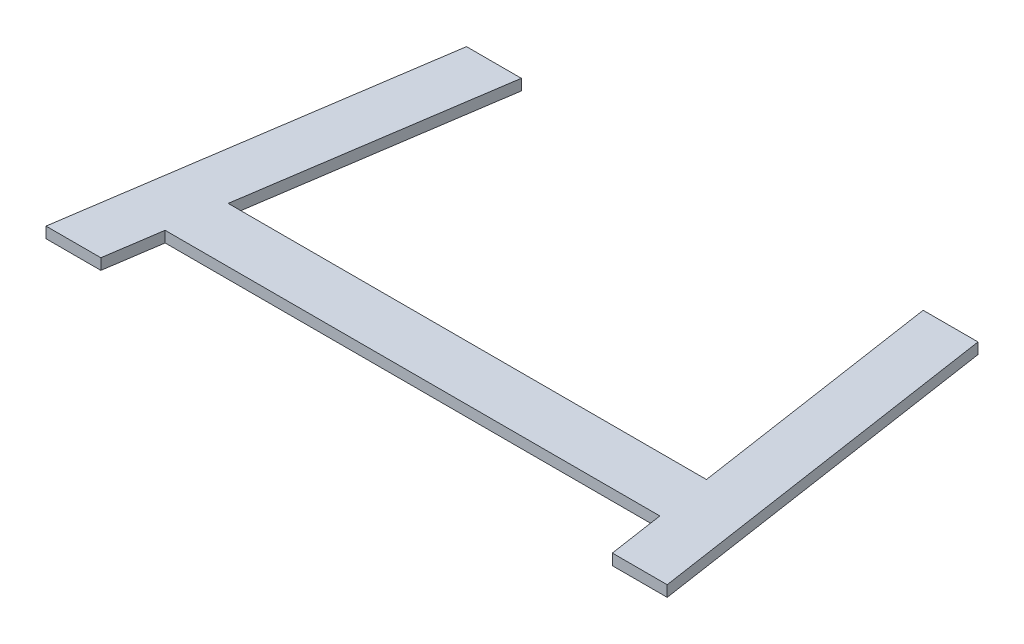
ISO-10303-21;
HEADER;
FILE_DESCRIPTION(('STEP AP214'),'2;1');
FILE_NAME('part.step','',(''),(''),'','','');
FILE_SCHEMA(('AUTOMOTIVE_DESIGN { 1 0 10303 214 1 1 1 1 }'));
ENDSEC;
DATA;
#1=APPLICATION_CONTEXT('core data for automotive mechanical design processes');
#2=APPLICATION_PROTOCOL_DEFINITION('international standard','automotive_design',2000,#1);
#3=PRODUCT_CONTEXT('',#1,'mechanical');
#4=PRODUCT('Part','Part','',(#3));
#5=PRODUCT_RELATED_PRODUCT_CATEGORY('part','',(#4));
#6=PRODUCT_DEFINITION_FORMATION('','',#4);
#7=PRODUCT_DEFINITION_CONTEXT('part definition',#1,'design');
#8=PRODUCT_DEFINITION('design','',#6,#7);
#9=PRODUCT_DEFINITION_SHAPE('','',#8);
#10=(LENGTH_UNIT() NAMED_UNIT(*) SI_UNIT(.MILLI.,.METRE.));
#11=(NAMED_UNIT(*) PLANE_ANGLE_UNIT() SI_UNIT($,.RADIAN.));
#12=(NAMED_UNIT(*) SI_UNIT($,.STERADIAN.) SOLID_ANGLE_UNIT());
#13=UNCERTAINTY_MEASURE_WITH_UNIT(LENGTH_MEASURE(1.E-05),#10,'distance_accuracy_value','');
#14=(GEOMETRIC_REPRESENTATION_CONTEXT(3) GLOBAL_UNCERTAINTY_ASSIGNED_CONTEXT((#13)) GLOBAL_UNIT_ASSIGNED_CONTEXT((#10,
#11,#12)) REPRESENTATION_CONTEXT('',''));
#15=CARTESIAN_POINT('',(0.,0.,0.));
#16=DIRECTION('',(0.,0.,1.));
#17=DIRECTION('',(1.,0.,0.));
#18=AXIS2_PLACEMENT_3D('',#15,#16,#17);
#19=CARTESIAN_POINT('',(30.,12.,-200.));
#20=DIRECTION('',(-0.988936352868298,0.,-0.148340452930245));
#21=DIRECTION('',(-0.148340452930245,0.,0.988936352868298));
#22=AXIS2_PLACEMENT_3D('',#19,#20,#21);
#23=PLANE('',#22);
#24=DIRECTION('',(0.148340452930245,0.,-0.988936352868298));
#25=VECTOR('',#24,1.);
#26=CARTESIAN_POINT('',(30.,0.,-200.));
#27=LINE('',#26,#25);
#28=CARTESIAN_POINT('',(-11.8291625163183,0.,78.8610834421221));
#29=VERTEX_POINT('',#28);
#30=CARTESIAN_POINT('',(30.,0.,-200.));
#31=VERTEX_POINT('',#30);
#32=EDGE_CURVE('E164',#29,#31,#27,.T.);
#33=ORIENTED_EDGE('',*,*,#32,.T.);
#34=DIRECTION('',(0.,-1.,0.));
#35=VECTOR('',#34,1.);
#36=CARTESIAN_POINT('',(30.,12.,-200.));
#37=LINE('',#36,#35);
#38=CARTESIAN_POINT('',(30.,12.,-200.));
#39=VERTEX_POINT('',#38);
#40=EDGE_CURVE('E11',#39,#31,#37,.T.);
#41=ORIENTED_EDGE('',*,*,#40,.F.);
#42=DIRECTION('',(0.148340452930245,0.,-0.988936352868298));
#43=VECTOR('',#42,1.);
#44=CARTESIAN_POINT('',(30.,12.,-200.));
#45=LINE('',#44,#43);
#46=CARTESIAN_POINT('',(-11.8291625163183,12.,78.8610834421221));
#47=VERTEX_POINT('',#46);
#48=EDGE_CURVE('E198',#47,#39,#45,.T.);
#49=ORIENTED_EDGE('',*,*,#48,.F.);
#50=DIRECTION('',(0.,-1.,0.));
#51=VECTOR('',#50,1.);
#52=CARTESIAN_POINT('',(-11.8291625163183,12.,78.8610834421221));
#53=LINE('',#52,#51);
#54=EDGE_CURVE('E160',#47,#29,#53,.T.);
#55=ORIENTED_EDGE('',*,*,#54,.T.);
#56=EDGE_LOOP('',(#33,#41,#49,#55));
#57=FACE_BOUND('',#56,.T.);
#58=ADVANCED_FACE('F39',(#57),#23,.F.);
#59=CARTESIAN_POINT('',(-30.,12.,-200.));
#60=DIRECTION('',(0.,0.,1.));
#61=DIRECTION('',(1.,0.,0.));
#62=AXIS2_PLACEMENT_3D('',#59,#60,#61);
#63=PLANE('',#62);
#64=DIRECTION('',(-1.,0.,0.));
#65=VECTOR('',#64,1.);
#66=CARTESIAN_POINT('',(-30.,0.,-200.));
#67=LINE('',#66,#65);
#68=CARTESIAN_POINT('',(-30.,0.,-200.));
#69=VERTEX_POINT('',#68);
#70=EDGE_CURVE('E168',#31,#69,#67,.T.);
#71=ORIENTED_EDGE('',*,*,#70,.T.);
#72=DIRECTION('',(0.,-1.,0.));
#73=VECTOR('',#72,1.);
#74=CARTESIAN_POINT('',(-30.,12.,-200.));
#75=LINE('',#74,#73);
#76=CARTESIAN_POINT('',(-30.,12.,-200.));
#77=VERTEX_POINT('',#76);
#78=EDGE_CURVE('E48',#77,#69,#75,.T.);
#79=ORIENTED_EDGE('',*,*,#78,.F.);
#80=DIRECTION('',(-1.,0.,0.));
#81=VECTOR('',#80,1.);
#82=CARTESIAN_POINT('',(-30.,12.,-200.));
#83=LINE('',#82,#81);
#84=EDGE_CURVE('E111',#39,#77,#83,.T.);
#85=ORIENTED_EDGE('',*,*,#84,.F.);
#86=ORIENTED_EDGE('',*,*,#40,.T.);
#87=EDGE_LOOP('',(#71,#79,#85,#86));
#88=FACE_BOUND('',#87,.T.);
#89=ADVANCED_FACE('F292',(#88),#63,.F.);
#90=CARTESIAN_POINT('',(-30.,12.,-200.));
#91=DIRECTION('',(0.988936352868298,0.,0.148340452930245));
#92=DIRECTION('',(0.148340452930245,0.,-0.988936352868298));
#93=AXIS2_PLACEMENT_3D('',#90,#91,#92);
#94=PLANE('',#93);
#95=DIRECTION('',(-0.148340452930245,0.,0.988936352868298));
#96=VECTOR('',#95,1.);
#97=CARTESIAN_POINT('',(-30.,0.,-200.));
#98=LINE('',#97,#96);
#99=CARTESIAN_POINT('',(-90.,0.,200.));
#100=VERTEX_POINT('',#99);
#101=EDGE_CURVE('E171',#69,#100,#98,.T.);
#102=ORIENTED_EDGE('',*,*,#101,.T.);
#103=DIRECTION('',(0.,-1.,0.));
#104=VECTOR('',#103,1.);
#105=CARTESIAN_POINT('',(-90.,12.,200.));
#106=LINE('',#105,#104);
#107=CARTESIAN_POINT('',(-90.,12.,200.));
#108=VERTEX_POINT('',#107);
#109=EDGE_CURVE('E225',#108,#100,#106,.T.);
#110=ORIENTED_EDGE('',*,*,#109,.F.);
#111=DIRECTION('',(-0.148340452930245,0.,0.988936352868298));
#112=VECTOR('',#111,1.);
#113=CARTESIAN_POINT('',(-30.,12.,-200.));
#114=LINE('',#113,#112);
#115=EDGE_CURVE('E235',#77,#108,#114,.T.);
#116=ORIENTED_EDGE('',*,*,#115,.F.);
#117=ORIENTED_EDGE('',*,*,#78,.T.);
#118=EDGE_LOOP('',(#102,#110,#116,#117));
#119=FACE_BOUND('',#118,.T.);
#120=ADVANCED_FACE('F233',(#119),#94,.F.);
#121=CARTESIAN_POINT('',(-90.,12.,200.));
#122=DIRECTION('',(0.,0.,-1.));
#123=DIRECTION('',(-1.,0.,0.));
#124=AXIS2_PLACEMENT_3D('',#121,#122,#123);
#125=PLANE('',#124);
#126=DIRECTION('',(1.,0.,0.));
#127=VECTOR('',#126,1.);
#128=CARTESIAN_POINT('',(-90.,0.,200.));
#129=LINE('',#128,#127);
#130=CARTESIAN_POINT('',(-30.,0.,200.));
#131=VERTEX_POINT('',#130);
#132=EDGE_CURVE('E174',#100,#131,#129,.T.);
#133=ORIENTED_EDGE('',*,*,#132,.T.);
#134=DIRECTION('',(0.,-1.,0.));
#135=VECTOR('',#134,1.);
#136=CARTESIAN_POINT('',(-30.,12.,200.));
#137=LINE('',#136,#135);
#138=CARTESIAN_POINT('',(-30.,12.,200.));
#139=VERTEX_POINT('',#138);
#140=EDGE_CURVE('E221',#139,#131,#137,.T.);
#141=ORIENTED_EDGE('',*,*,#140,.F.);
#142=DIRECTION('',(1.,0.,0.));
#143=VECTOR('',#142,1.);
#144=CARTESIAN_POINT('',(-90.,12.,200.));
#145=LINE('',#144,#143);
#146=EDGE_CURVE('E254',#108,#139,#145,.T.);
#147=ORIENTED_EDGE('',*,*,#146,.F.);
#148=ORIENTED_EDGE('',*,*,#109,.T.);
#149=EDGE_LOOP('',(#133,#141,#147,#148));
#150=FACE_BOUND('',#149,.T.);
#151=ADVANCED_FACE('F244',(#150),#125,.F.);
#152=CARTESIAN_POINT('',(-30.,12.,200.));
#153=DIRECTION('',(-0.988936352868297,0.,-0.148340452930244));
#154=DIRECTION('',(-0.148340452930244,0.,0.988936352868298));
#155=AXIS2_PLACEMENT_3D('',#152,#153,#154);
#156=PLANE('',#155);
#157=DIRECTION('',(0.148340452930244,0.,-0.988936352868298));
#158=VECTOR('',#157,1.);
#159=CARTESIAN_POINT('',(-30.,0.,200.));
#160=LINE('',#159,#158);
#161=CARTESIAN_POINT('',(-20.8291625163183,0.,138.861083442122));
#162=VERTEX_POINT('',#161);
#163=EDGE_CURVE('E177',#131,#162,#160,.T.);
#164=ORIENTED_EDGE('',*,*,#163,.T.);
#165=DIRECTION('',(0.,-1.,0.));
#166=VECTOR('',#165,1.);
#167=CARTESIAN_POINT('',(-20.8291625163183,12.,138.861083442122));
#168=LINE('',#167,#166);
#169=CARTESIAN_POINT('',(-20.8291625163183,12.,138.861083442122));
#170=VERTEX_POINT('',#169);
#171=EDGE_CURVE('E217',#170,#162,#168,.T.);
#172=ORIENTED_EDGE('',*,*,#171,.F.);
#173=DIRECTION('',(0.148340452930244,0.,-0.988936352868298));
#174=VECTOR('',#173,1.);
#175=CARTESIAN_POINT('',(-30.,12.,200.));
#176=LINE('',#175,#174);
#177=EDGE_CURVE('E250',#139,#170,#176,.T.);
#178=ORIENTED_EDGE('',*,*,#177,.F.);
#179=ORIENTED_EDGE('',*,*,#140,.T.);
#180=EDGE_LOOP('',(#164,#172,#178,#179));
#181=FACE_BOUND('',#180,.T.);
#182=ADVANCED_FACE('F248',(#181),#156,.F.);
#183=CARTESIAN_POINT('',(520.369162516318,12.,138.861083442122));
#184=DIRECTION('',(0.,0.,-1.));
#185=DIRECTION('',(-1.,0.,0.));
#186=AXIS2_PLACEMENT_3D('',#183,#184,#185);
#187=PLANE('',#186);
#188=DIRECTION('',(1.,0.,0.));
#189=VECTOR('',#188,1.);
#190=CARTESIAN_POINT('',(520.369162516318,0.,138.861083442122));
#191=LINE('',#190,#189);
#192=CARTESIAN_POINT('',(520.369162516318,0.,138.861083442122));
#193=VERTEX_POINT('',#192);
#194=EDGE_CURVE('E180',#162,#193,#191,.T.);
#195=ORIENTED_EDGE('',*,*,#194,.T.);
#196=DIRECTION('',(0.,-1.,0.));
#197=VECTOR('',#196,1.);
#198=CARTESIAN_POINT('',(520.369162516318,12.,138.861083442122));
#199=LINE('',#198,#197);
#200=CARTESIAN_POINT('',(520.369162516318,12.,138.861083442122));
#201=VERTEX_POINT('',#200);
#202=EDGE_CURVE('E213',#201,#193,#199,.T.);
#203=ORIENTED_EDGE('',*,*,#202,.F.);
#204=DIRECTION('',(1.,0.,0.));
#205=VECTOR('',#204,1.);
#206=CARTESIAN_POINT('',(520.369162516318,12.,138.861083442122));
#207=LINE('',#206,#205);
#208=EDGE_CURVE('E253',#170,#201,#207,.T.);
#209=ORIENTED_EDGE('',*,*,#208,.F.);
#210=ORIENTED_EDGE('',*,*,#171,.T.);
#211=EDGE_LOOP('',(#195,#203,#209,#210));
#212=FACE_BOUND('',#211,.T.);
#213=ADVANCED_FACE('F305',(#212),#187,.F.);
#214=CARTESIAN_POINT('',(529.54,12.,200.));
#215=DIRECTION('',(0.988936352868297,0.,-0.148340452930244));
#216=DIRECTION('',(-0.148340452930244,0.,-0.988936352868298));
#217=AXIS2_PLACEMENT_3D('',#214,#215,#216);
#218=PLANE('',#217);
#219=DIRECTION('',(0.148340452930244,0.,0.988936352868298));
#220=VECTOR('',#219,1.);
#221=CARTESIAN_POINT('',(529.54,0.,200.));
#222=LINE('',#221,#220);
#223=CARTESIAN_POINT('',(529.54,0.,200.));
#224=VERTEX_POINT('',#223);
#225=EDGE_CURVE('E183',#193,#224,#222,.T.);
#226=ORIENTED_EDGE('',*,*,#225,.T.);
#227=DIRECTION('',(0.,-1.,0.));
#228=VECTOR('',#227,1.);
#229=CARTESIAN_POINT('',(529.54,12.,200.));
#230=LINE('',#229,#228);
#231=CARTESIAN_POINT('',(529.54,12.,200.));
#232=VERTEX_POINT('',#231);
#233=EDGE_CURVE('E209',#232,#224,#230,.T.);
#234=ORIENTED_EDGE('',*,*,#233,.F.);
#235=DIRECTION('',(0.148340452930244,0.,0.988936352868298));
#236=VECTOR('',#235,1.);
#237=CARTESIAN_POINT('',(529.54,12.,200.));
#238=LINE('',#237,#236);
#239=EDGE_CURVE('E258',#201,#232,#238,.T.);
#240=ORIENTED_EDGE('',*,*,#239,.F.);
#241=ORIENTED_EDGE('',*,*,#202,.T.);
#242=EDGE_LOOP('',(#226,#234,#240,#241));
#243=FACE_BOUND('',#242,.T.);
#244=ADVANCED_FACE('F308',(#243),#218,.F.);
#245=CARTESIAN_POINT('',(589.54,12.,200.));
#246=DIRECTION('',(0.,0.,-1.));
#247=DIRECTION('',(-1.,0.,0.));
#248=AXIS2_PLACEMENT_3D('',#245,#246,#247);
#249=PLANE('',#248);
#250=DIRECTION('',(1.,0.,0.));
#251=VECTOR('',#250,1.);
#252=CARTESIAN_POINT('',(589.54,0.,200.));
#253=LINE('',#252,#251);
#254=CARTESIAN_POINT('',(589.54,0.,200.));
#255=VERTEX_POINT('',#254);
#256=EDGE_CURVE('E186',#224,#255,#253,.T.);
#257=ORIENTED_EDGE('',*,*,#256,.T.);
#258=DIRECTION('',(0.,-1.,0.));
#259=VECTOR('',#258,1.);
#260=CARTESIAN_POINT('',(589.54,12.,200.));
#261=LINE('',#260,#259);
#262=CARTESIAN_POINT('',(589.54,12.,200.));
#263=VERTEX_POINT('',#262);
#264=EDGE_CURVE('E205',#263,#255,#261,.T.);
#265=ORIENTED_EDGE('',*,*,#264,.F.);
#266=DIRECTION('',(1.,0.,0.));
#267=VECTOR('',#266,1.);
#268=CARTESIAN_POINT('',(589.54,12.,200.));
#269=LINE('',#268,#267);
#270=EDGE_CURVE('E265',#232,#263,#269,.T.);
#271=ORIENTED_EDGE('',*,*,#270,.F.);
#272=ORIENTED_EDGE('',*,*,#233,.T.);
#273=EDGE_LOOP('',(#257,#265,#271,#272));
#274=FACE_BOUND('',#273,.T.);
#275=ADVANCED_FACE('F273',(#274),#249,.F.);
#276=CARTESIAN_POINT('',(529.54,12.,-200.));
#277=DIRECTION('',(-0.988936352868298,0.,0.148340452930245));
#278=DIRECTION('',(0.148340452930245,0.,0.988936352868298));
#279=AXIS2_PLACEMENT_3D('',#276,#277,#278);
#280=PLANE('',#279);
#281=DIRECTION('',(-0.148340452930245,0.,-0.988936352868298));
#282=VECTOR('',#281,1.);
#283=CARTESIAN_POINT('',(529.54,0.,-200.));
#284=LINE('',#283,#282);
#285=CARTESIAN_POINT('',(529.54,0.,-200.));
#286=VERTEX_POINT('',#285);
#287=EDGE_CURVE('E189',#255,#286,#284,.T.);
#288=ORIENTED_EDGE('',*,*,#287,.T.);
#289=DIRECTION('',(0.,-1.,0.));
#290=VECTOR('',#289,1.);
#291=CARTESIAN_POINT('',(529.54,12.,-200.));
#292=LINE('',#291,#290);
#293=CARTESIAN_POINT('',(529.54,12.,-200.));
#294=VERTEX_POINT('',#293);
#295=EDGE_CURVE('E153',#294,#286,#292,.T.);
#296=ORIENTED_EDGE('',*,*,#295,.F.);
#297=DIRECTION('',(-0.148340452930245,0.,-0.988936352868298));
#298=VECTOR('',#297,1.);
#299=CARTESIAN_POINT('',(529.54,12.,-200.));
#300=LINE('',#299,#298);
#301=EDGE_CURVE('E142',#263,#294,#300,.T.);
#302=ORIENTED_EDGE('',*,*,#301,.F.);
#303=ORIENTED_EDGE('',*,*,#264,.T.);
#304=EDGE_LOOP('',(#288,#296,#302,#303));
#305=FACE_BOUND('',#304,.T.);
#306=ADVANCED_FACE('F277',(#305),#280,.F.);
#307=CARTESIAN_POINT('',(529.54,12.,-200.));
#308=DIRECTION('',(0.,0.,1.));
#309=DIRECTION('',(1.,0.,0.));
#310=AXIS2_PLACEMENT_3D('',#307,#308,#309);
#311=PLANE('',#310);
#312=DIRECTION('',(-1.,0.,0.));
#313=VECTOR('',#312,1.);
#314=CARTESIAN_POINT('',(529.54,0.,-200.));
#315=LINE('',#314,#313);
#316=CARTESIAN_POINT('',(469.54,0.,-200.));
#317=VERTEX_POINT('',#316);
#318=EDGE_CURVE('E151',#286,#317,#315,.T.);
#319=ORIENTED_EDGE('',*,*,#318,.T.);
#320=DIRECTION('',(0.,-1.,0.));
#321=VECTOR('',#320,1.);
#322=CARTESIAN_POINT('',(469.54,12.,-200.));
#323=LINE('',#322,#321);
#324=CARTESIAN_POINT('',(469.54,12.,-200.));
#325=VERTEX_POINT('',#324);
#326=EDGE_CURVE('E148',#325,#317,#323,.T.);
#327=ORIENTED_EDGE('',*,*,#326,.F.);
#328=DIRECTION('',(-1.,0.,0.));
#329=VECTOR('',#328,1.);
#330=CARTESIAN_POINT('',(529.54,12.,-200.));
#331=LINE('',#330,#329);
#332=EDGE_CURVE('E136',#294,#325,#331,.T.);
#333=ORIENTED_EDGE('',*,*,#332,.F.);
#334=ORIENTED_EDGE('',*,*,#295,.T.);
#335=EDGE_LOOP('',(#319,#327,#333,#334));
#336=FACE_BOUND('',#335,.T.);
#337=ADVANCED_FACE('F149',(#336),#311,.F.);
#338=CARTESIAN_POINT('',(469.54,12.,-200.));
#339=DIRECTION('',(0.988936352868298,0.,-0.148340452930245));
#340=DIRECTION('',(-0.148340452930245,0.,-0.988936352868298));
#341=AXIS2_PLACEMENT_3D('',#338,#339,#340);
#342=PLANE('',#341);
#343=DIRECTION('',(0.148340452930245,0.,0.988936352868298));
#344=VECTOR('',#343,1.);
#345=CARTESIAN_POINT('',(469.54,0.,-200.));
#346=LINE('',#345,#344);
#347=CARTESIAN_POINT('',(511.369162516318,0.,78.8610834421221));
#348=VERTEX_POINT('',#347);
#349=EDGE_CURVE('E97',#317,#348,#346,.T.);
#350=ORIENTED_EDGE('',*,*,#349,.T.);
#351=DIRECTION('',(0.,-1.,0.));
#352=VECTOR('',#351,1.);
#353=CARTESIAN_POINT('',(511.369162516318,12.,78.8610834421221));
#354=LINE('',#353,#352);
#355=CARTESIAN_POINT('',(511.369162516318,12.,78.8610834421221));
#356=VERTEX_POINT('',#355);
#357=EDGE_CURVE('E154',#356,#348,#354,.T.);
#358=ORIENTED_EDGE('',*,*,#357,.F.);
#359=DIRECTION('',(0.148340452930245,0.,0.988936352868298));
#360=VECTOR('',#359,1.);
#361=CARTESIAN_POINT('',(469.54,12.,-200.));
#362=LINE('',#361,#360);
#363=EDGE_CURVE('E140',#325,#356,#362,.T.);
#364=ORIENTED_EDGE('',*,*,#363,.F.);
#365=ORIENTED_EDGE('',*,*,#326,.T.);
#366=EDGE_LOOP('',(#350,#358,#364,#365));
#367=FACE_BOUND('',#366,.T.);
#368=ADVANCED_FACE('F156',(#367),#342,.F.);
#369=CARTESIAN_POINT('',(-11.8291625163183,12.,78.8610834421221));
#370=DIRECTION('',(0.,0.,1.));
#371=DIRECTION('',(1.,0.,0.));
#372=AXIS2_PLACEMENT_3D('',#369,#370,#371);
#373=PLANE('',#372);
#374=DIRECTION('',(-1.,0.,0.));
#375=VECTOR('',#374,1.);
#376=CARTESIAN_POINT('',(-11.8291625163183,0.,78.8610834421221));
#377=LINE('',#376,#375);
#378=EDGE_CURVE('E103',#348,#29,#377,.T.);
#379=ORIENTED_EDGE('',*,*,#378,.T.);
#380=ORIENTED_EDGE('',*,*,#54,.F.);
#381=DIRECTION('',(-1.,0.,0.));
#382=VECTOR('',#381,1.);
#383=CARTESIAN_POINT('',(-11.8291625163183,12.,78.8610834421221));
#384=LINE('',#383,#382);
#385=EDGE_CURVE('E56',#356,#47,#384,.T.);
#386=ORIENTED_EDGE('',*,*,#385,.F.);
#387=ORIENTED_EDGE('',*,*,#357,.T.);
#388=EDGE_LOOP('',(#379,#380,#386,#387));
#389=FACE_BOUND('',#388,.T.);
#390=ADVANCED_FACE('F281',(#389),#373,.F.);
#391=CARTESIAN_POINT('',(0.,12.,0.));
#392=DIRECTION('',(0.,1.,0.));
#393=DIRECTION('',(0.,0.,1.));
#394=AXIS2_PLACEMENT_3D('',#391,#392,#393);
#395=PLANE('',#394);
#396=ORIENTED_EDGE('',*,*,#48,.T.);
#397=ORIENTED_EDGE('',*,*,#84,.T.);
#398=ORIENTED_EDGE('',*,*,#115,.T.);
#399=ORIENTED_EDGE('',*,*,#146,.T.);
#400=ORIENTED_EDGE('',*,*,#177,.T.);
#401=ORIENTED_EDGE('',*,*,#208,.T.);
#402=ORIENTED_EDGE('',*,*,#239,.T.);
#403=ORIENTED_EDGE('',*,*,#270,.T.);
#404=ORIENTED_EDGE('',*,*,#301,.T.);
#405=ORIENTED_EDGE('',*,*,#332,.T.);
#406=ORIENTED_EDGE('',*,*,#363,.T.);
#407=ORIENTED_EDGE('',*,*,#385,.T.);
#408=EDGE_LOOP('',(#396,#397,#398,#399,#400,#401,#402,#403,#404,#405,#406,#407));
#409=FACE_BOUND('',#408,.T.);
#410=ADVANCED_FACE('F138',(#409),#395,.T.);
#411=CARTESIAN_POINT('',(0.,0.,0.));
#412=DIRECTION('',(0.,1.,0.));
#413=DIRECTION('',(0.,0.,1.));
#414=AXIS2_PLACEMENT_3D('',#411,#412,#413);
#415=PLANE('',#414);
#416=ORIENTED_EDGE('',*,*,#32,.F.);
#417=ORIENTED_EDGE('',*,*,#378,.F.);
#418=ORIENTED_EDGE('',*,*,#349,.F.);
#419=ORIENTED_EDGE('',*,*,#318,.F.);
#420=ORIENTED_EDGE('',*,*,#287,.F.);
#421=ORIENTED_EDGE('',*,*,#256,.F.);
#422=ORIENTED_EDGE('',*,*,#225,.F.);
#423=ORIENTED_EDGE('',*,*,#194,.F.);
#424=ORIENTED_EDGE('',*,*,#163,.F.);
#425=ORIENTED_EDGE('',*,*,#132,.F.);
#426=ORIENTED_EDGE('',*,*,#101,.F.);
#427=ORIENTED_EDGE('',*,*,#70,.F.);
#428=EDGE_LOOP('',(#416,#417,#418,#419,#420,#421,#422,#423,#424,#425,#426,#427));
#429=FACE_BOUND('',#428,.T.);
#430=ADVANCED_FACE('F239',(#429),#415,.F.);
#431=CLOSED_SHELL('',(#58,#89,#120,#151,#182,#213,#244,#275,#306,#337,#368,#390,#410,#430));
#432=MANIFOLD_SOLID_BREP('B2',#431);
#433=ADVANCED_BREP_SHAPE_REPRESENTATION('',(#18,#432),#14);
#434=SHAPE_DEFINITION_REPRESENTATION(#9,#433);
ENDSEC;
END-ISO-10303-21;
